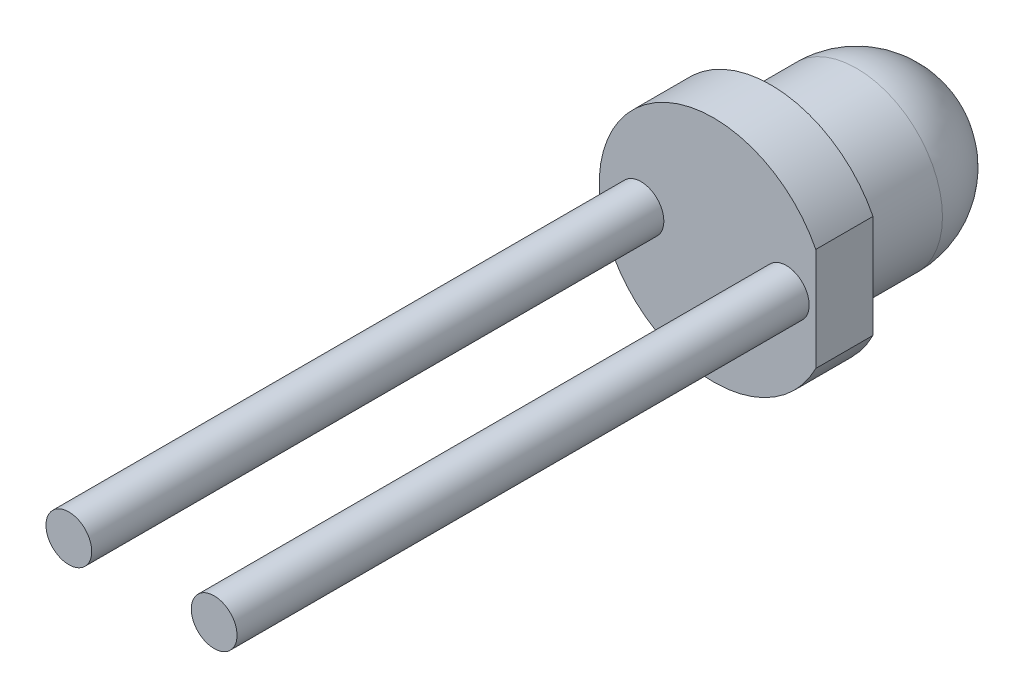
ISO-10303-21;
HEADER;
FILE_DESCRIPTION(('STEP AP214'),'2;1');
FILE_NAME('part.step','',(''),(''),'','','');
FILE_SCHEMA(('AUTOMOTIVE_DESIGN { 1 0 10303 214 1 1 1 1 }'));
ENDSEC;
DATA;
#1=APPLICATION_CONTEXT('core data for automotive mechanical design processes');
#2=APPLICATION_PROTOCOL_DEFINITION('international standard','automotive_design',2000,#1);
#3=PRODUCT_CONTEXT('',#1,'mechanical');
#4=PRODUCT('Part','Part','',(#3));
#5=PRODUCT_RELATED_PRODUCT_CATEGORY('part','',(#4));
#6=PRODUCT_DEFINITION_FORMATION('','',#4);
#7=PRODUCT_DEFINITION_CONTEXT('part definition',#1,'design');
#8=PRODUCT_DEFINITION('design','',#6,#7);
#9=PRODUCT_DEFINITION_SHAPE('','',#8);
#10=(LENGTH_UNIT() NAMED_UNIT(*) SI_UNIT(.MILLI.,.METRE.));
#11=(NAMED_UNIT(*) PLANE_ANGLE_UNIT() SI_UNIT($,.RADIAN.));
#12=(NAMED_UNIT(*) SI_UNIT($,.STERADIAN.) SOLID_ANGLE_UNIT());
#13=UNCERTAINTY_MEASURE_WITH_UNIT(LENGTH_MEASURE(1.E-05),#10,'distance_accuracy_value','');
#14=(GEOMETRIC_REPRESENTATION_CONTEXT(3) GLOBAL_UNCERTAINTY_ASSIGNED_CONTEXT((#13)) GLOBAL_UNIT_ASSIGNED_CONTEXT((#10,
#11,#12)) REPRESENTATION_CONTEXT('',''));
#15=CARTESIAN_POINT('',(0.,0.,0.));
#16=DIRECTION('',(0.,0.,1.));
#17=DIRECTION('',(1.,0.,0.));
#18=AXIS2_PLACEMENT_3D('',#15,#16,#17);
#19=CARTESIAN_POINT('',(0.,0.,4.));
#20=DIRECTION('',(0.,0.,1.));
#21=DIRECTION('',(1.,0.,0.));
#22=AXIS2_PLACEMENT_3D('',#19,#20,#21);
#23=PLANE('',#22);
#24=CARTESIAN_POINT('',(1.27,0.,4.));
#25=DIRECTION('',(0.,0.,1.));
#26=DIRECTION('',(1.,0.,0.));
#27=AXIS2_PLACEMENT_3D('',#24,#25,#26);
#28=CIRCLE('',#27,0.4);
#29=CARTESIAN_POINT('',(1.67,0.,4.));
#30=VERTEX_POINT('',#29);
#31=EDGE_CURVE('E151',#30,#30,#28,.T.);
#32=ORIENTED_EDGE('',*,*,#31,.F.);
#33=EDGE_LOOP('',(#32));
#34=FACE_BOUND('',#33,.T.);
#35=CARTESIAN_POINT('',(0.,0.,4.));
#36=DIRECTION('',(0.,0.,1.));
#37=DIRECTION('',(1.,0.,0.));
#38=AXIS2_PLACEMENT_3D('',#35,#36,#37);
#39=CIRCLE('',#38,2.);
#40=CARTESIAN_POINT('',(1.78571428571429,0.900680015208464,4.));
#41=VERTEX_POINT('',#40);
#42=CARTESIAN_POINT('',(1.78571428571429,-0.900680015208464,4.));
#43=VERTEX_POINT('',#42);
#44=EDGE_CURVE('E55',#41,#43,#39,.T.);
#45=ORIENTED_EDGE('',*,*,#44,.T.);
#46=DIRECTION('',(0.,1.,0.));
#47=VECTOR('',#46,1.);
#48=CARTESIAN_POINT('',(1.78571428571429,0.900680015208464,4.));
#49=LINE('',#48,#47);
#50=EDGE_CURVE('E63',#43,#41,#49,.T.);
#51=ORIENTED_EDGE('',*,*,#50,.T.);
#52=EDGE_LOOP('',(#45,#51));
#53=FACE_BOUND('',#52,.T.);
#54=CARTESIAN_POINT('',(-1.27,0.,4.));
#55=DIRECTION('',(0.,0.,1.));
#56=DIRECTION('',(1.,0.,0.));
#57=AXIS2_PLACEMENT_3D('',#54,#55,#56);
#58=CIRCLE('',#57,0.4);
#59=CARTESIAN_POINT('',(-0.87,0.,4.));
#60=VERTEX_POINT('',#59);
#61=EDGE_CURVE('E152',#60,#60,#58,.T.);
#62=ORIENTED_EDGE('',*,*,#61,.F.);
#63=EDGE_LOOP('',(#62));
#64=FACE_BOUND('',#63,.T.);
#65=ADVANCED_FACE('F26',(#34,#53,#64),#23,.T.);
#66=CARTESIAN_POINT('',(0.,0.,4.));
#67=DIRECTION('',(0.,0.,-1.));
#68=DIRECTION('',(-1.,0.,0.));
#69=AXIS2_PLACEMENT_3D('',#66,#67,#68);
#70=CYLINDRICAL_SURFACE('',#69,1.5);
#71=CARTESIAN_POINT('',(0.,0.,1.5));
#72=DIRECTION('',(0.,0.,-1.));
#73=DIRECTION('',(-1.,0.,0.));
#74=AXIS2_PLACEMENT_3D('',#71,#72,#73);
#75=CIRCLE('',#74,1.5);
#76=CARTESIAN_POINT('',(-1.5,0.,1.5));
#77=VERTEX_POINT('',#76);
#78=EDGE_CURVE('E11',#77,#77,#75,.F.);
#79=ORIENTED_EDGE('',*,*,#78,.T.);
#80=EDGE_LOOP('',(#79));
#81=FACE_BOUND('',#80,.T.);
#82=CARTESIAN_POINT('',(0.,0.,3.));
#83=DIRECTION('',(0.,0.,1.));
#84=DIRECTION('',(1.,0.,0.));
#85=AXIS2_PLACEMENT_3D('',#82,#83,#84);
#86=CIRCLE('',#85,1.5);
#87=CARTESIAN_POINT('',(1.5,0.,3.));
#88=VERTEX_POINT('',#87);
#89=EDGE_CURVE('E34',#88,#88,#86,.T.);
#90=ORIENTED_EDGE('',*,*,#89,.F.);
#91=EDGE_LOOP('',(#90));
#92=FACE_BOUND('',#91,.T.);
#93=ADVANCED_FACE('F28',(#81,#92),#70,.T.);
#94=CARTESIAN_POINT('',(0.,0.,3.));
#95=DIRECTION('',(0.,0.,1.));
#96=DIRECTION('',(1.,0.,0.));
#97=AXIS2_PLACEMENT_3D('',#94,#95,#96);
#98=PLANE('',#97);
#99=CARTESIAN_POINT('',(0.,0.,3.));
#100=DIRECTION('',(0.,0.,1.));
#101=DIRECTION('',(1.,0.,0.));
#102=AXIS2_PLACEMENT_3D('',#99,#100,#101);
#103=CIRCLE('',#102,2.);
#104=CARTESIAN_POINT('',(1.78571428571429,0.900680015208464,3.));
#105=VERTEX_POINT('',#104);
#106=CARTESIAN_POINT('',(1.78571428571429,-0.900680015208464,3.));
#107=VERTEX_POINT('',#106);
#108=EDGE_CURVE('E57',#105,#107,#103,.T.);
#109=ORIENTED_EDGE('',*,*,#108,.F.);
#110=DIRECTION('',(0.,1.,0.));
#111=VECTOR('',#110,1.);
#112=CARTESIAN_POINT('',(1.78571428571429,0.900680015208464,3.));
#113=LINE('',#112,#111);
#114=EDGE_CURVE('E59',#107,#105,#113,.T.);
#115=ORIENTED_EDGE('',*,*,#114,.F.);
#116=EDGE_LOOP('',(#109,#115));
#117=FACE_BOUND('',#116,.T.);
#118=ORIENTED_EDGE('',*,*,#89,.T.);
#119=EDGE_LOOP('',(#118));
#120=FACE_BOUND('',#119,.T.);
#121=ADVANCED_FACE('F75',(#117,#120),#98,.F.);
#122=CARTESIAN_POINT('',(0.,0.,3.));
#123=DIRECTION('',(0.,0.,1.));
#124=DIRECTION('',(1.,0.,0.));
#125=AXIS2_PLACEMENT_3D('',#122,#123,#124);
#126=CYLINDRICAL_SURFACE('',#125,2.);
#127=ORIENTED_EDGE('',*,*,#44,.F.);
#128=DIRECTION('',(0.,0.,1.));
#129=VECTOR('',#128,1.);
#130=CARTESIAN_POINT('',(1.78571428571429,0.900680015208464,3.));
#131=LINE('',#130,#129);
#132=EDGE_CURVE('E41',#105,#41,#131,.T.);
#133=ORIENTED_EDGE('',*,*,#132,.F.);
#134=ORIENTED_EDGE('',*,*,#108,.T.);
#135=DIRECTION('',(0.,0.,1.));
#136=VECTOR('',#135,1.);
#137=CARTESIAN_POINT('',(1.78571428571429,-0.900680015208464,3.));
#138=LINE('',#137,#136);
#139=EDGE_CURVE('E49',#107,#43,#138,.T.);
#140=ORIENTED_EDGE('',*,*,#139,.T.);
#141=EDGE_LOOP('',(#127,#133,#134,#140));
#142=FACE_BOUND('',#141,.T.);
#143=ADVANCED_FACE('F54',(#142),#126,.T.);
#144=CARTESIAN_POINT('',(1.78571428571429,0.900680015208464,3.));
#145=DIRECTION('',(1.,0.,0.));
#146=DIRECTION('',(0.,0.,-1.));
#147=AXIS2_PLACEMENT_3D('',#144,#145,#146);
#148=PLANE('',#147);
#149=ORIENTED_EDGE('',*,*,#50,.F.);
#150=ORIENTED_EDGE('',*,*,#139,.F.);
#151=ORIENTED_EDGE('',*,*,#114,.T.);
#152=ORIENTED_EDGE('',*,*,#132,.T.);
#153=EDGE_LOOP('',(#149,#150,#151,#152));
#154=FACE_BOUND('',#153,.T.);
#155=ADVANCED_FACE('F66',(#154),#148,.T.);
#156=CARTESIAN_POINT('',(0.,0.,1.5));
#157=DIRECTION('',(0.,0.,1.));
#158=DIRECTION('',(1.,0.,0.));
#159=AXIS2_PLACEMENT_3D('',#156,#157,#158);
#160=SPHERICAL_SURFACE('',#159,1.5);
#161=ORIENTED_EDGE('',*,*,#78,.F.);
#162=EDGE_LOOP('',(#161));
#163=FACE_BOUND('',#162,.T.);
#164=ADVANCED_FACE('F90',(#163),#160,.T.);
#165=CARTESIAN_POINT('',(1.27,0.,14.));
#166=DIRECTION('',(0.,0.,-1.));
#167=DIRECTION('',(-1.,0.,0.));
#168=AXIS2_PLACEMENT_3D('',#165,#166,#167);
#169=CYLINDRICAL_SURFACE('',#168,0.4);
#170=CARTESIAN_POINT('',(1.27,0.,14.));
#171=DIRECTION('',(0.,0.,1.));
#172=DIRECTION('',(1.,0.,0.));
#173=AXIS2_PLACEMENT_3D('',#170,#171,#172);
#174=CIRCLE('',#173,0.4);
#175=CARTESIAN_POINT('',(1.67,0.,14.));
#176=VERTEX_POINT('',#175);
#177=EDGE_CURVE('E64',#176,#176,#174,.T.);
#178=ORIENTED_EDGE('',*,*,#177,.F.);
#179=EDGE_LOOP('',(#178));
#180=FACE_BOUND('',#179,.T.);
#181=ORIENTED_EDGE('',*,*,#31,.T.);
#182=EDGE_LOOP('',(#181));
#183=FACE_BOUND('',#182,.T.);
#184=ADVANCED_FACE('F91',(#180,#183),#169,.T.);
#185=CARTESIAN_POINT('',(1.27,0.,14.));
#186=DIRECTION('',(0.,0.,1.));
#187=DIRECTION('',(1.,0.,0.));
#188=AXIS2_PLACEMENT_3D('',#185,#186,#187);
#189=PLANE('',#188);
#190=ORIENTED_EDGE('',*,*,#177,.T.);
#191=EDGE_LOOP('',(#190));
#192=FACE_BOUND('',#191,.T.);
#193=ADVANCED_FACE('F96',(#192),#189,.T.);
#194=CARTESIAN_POINT('',(-1.27,0.,14.));
#195=DIRECTION('',(0.,0.,-1.));
#196=DIRECTION('',(-1.,0.,0.));
#197=AXIS2_PLACEMENT_3D('',#194,#195,#196);
#198=CYLINDRICAL_SURFACE('',#197,0.4);
#199=CARTESIAN_POINT('',(-1.27,0.,14.));
#200=DIRECTION('',(0.,0.,1.));
#201=DIRECTION('',(1.,0.,0.));
#202=AXIS2_PLACEMENT_3D('',#199,#200,#201);
#203=CIRCLE('',#202,0.4);
#204=CARTESIAN_POINT('',(-0.87,0.,14.));
#205=VERTEX_POINT('',#204);
#206=EDGE_CURVE('E150',#205,#205,#203,.T.);
#207=ORIENTED_EDGE('',*,*,#206,.F.);
#208=EDGE_LOOP('',(#207));
#209=FACE_BOUND('',#208,.T.);
#210=ORIENTED_EDGE('',*,*,#61,.T.);
#211=EDGE_LOOP('',(#210));
#212=FACE_BOUND('',#211,.T.);
#213=ADVANCED_FACE('F131',(#209,#212),#198,.T.);
#214=CARTESIAN_POINT('',(-1.27,0.,14.));
#215=DIRECTION('',(0.,0.,1.));
#216=DIRECTION('',(1.,0.,0.));
#217=AXIS2_PLACEMENT_3D('',#214,#215,#216);
#218=PLANE('',#217);
#219=ORIENTED_EDGE('',*,*,#206,.T.);
#220=EDGE_LOOP('',(#219));
#221=FACE_BOUND('',#220,.T.);
#222=ADVANCED_FACE('F138',(#221),#218,.T.);
#223=CLOSED_SHELL('',(#65,#93,#121,#143,#155,#164,#184,#193,#213,#222));
#224=MANIFOLD_SOLID_BREP('B2',#223);
#225=ADVANCED_BREP_SHAPE_REPRESENTATION('',(#18,#224),#14);
#226=SHAPE_DEFINITION_REPRESENTATION(#9,#225);
ENDSEC;
END-ISO-10303-21;
